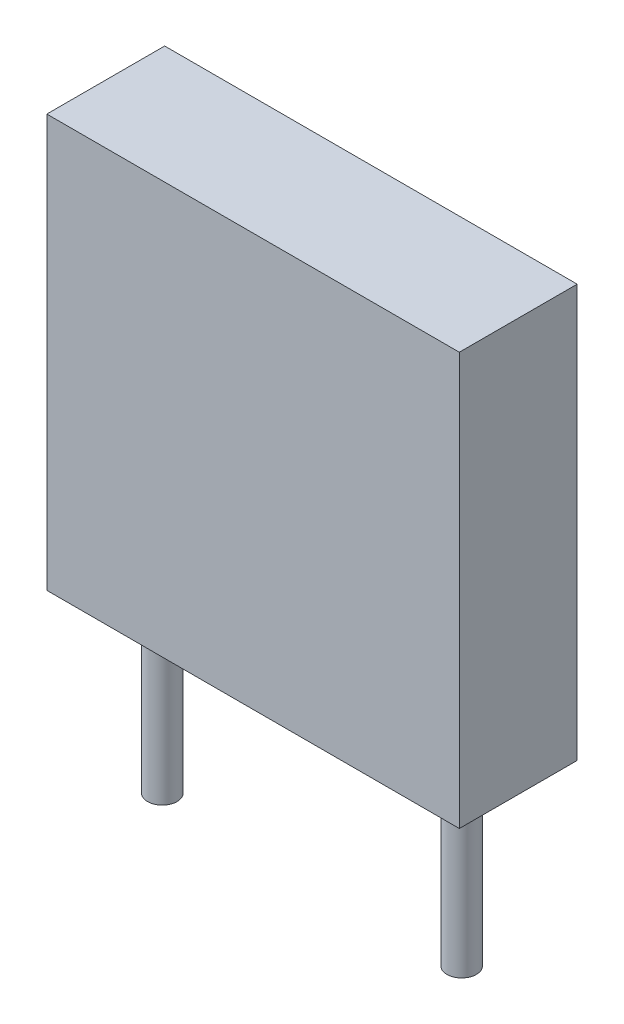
from build123d import *

# Parameters (mm, degrees)
ESQUISSE1_W      = 7
ESQUISSE1_H      = 2
EXTRUSION1_DEPTH = 7
ESQUISSE2_R      = 0.25
EXTRUSION2_DEPTH = 3


with BuildPart() as part:
    # Esquisse1 → Extrusion1 (new body)
    with BuildSketch(Plane(origin=(0, 0, 0), x_dir=(1, 0, 0), z_dir=(0, 1, 0))):
        with Locations((3.5, 1)):
            Rectangle(ESQUISSE1_W, ESQUISSE1_H)
    extrude(amount=EXTRUSION1_DEPTH)

    # Esquisse2 → Extrusion2 (add)
    with BuildSketch(Plane.XZ):
        with Locations(Location((0.96, -1, 0), (0, 0, 90))):
            Circle(ESQUISSE2_R)
        with Locations(Location((6.04, -1, 0), (0, 0, 270))):
            Circle(ESQUISSE2_R)
    extrude(amount=EXTRUSION2_DEPTH)


solid = part.part
